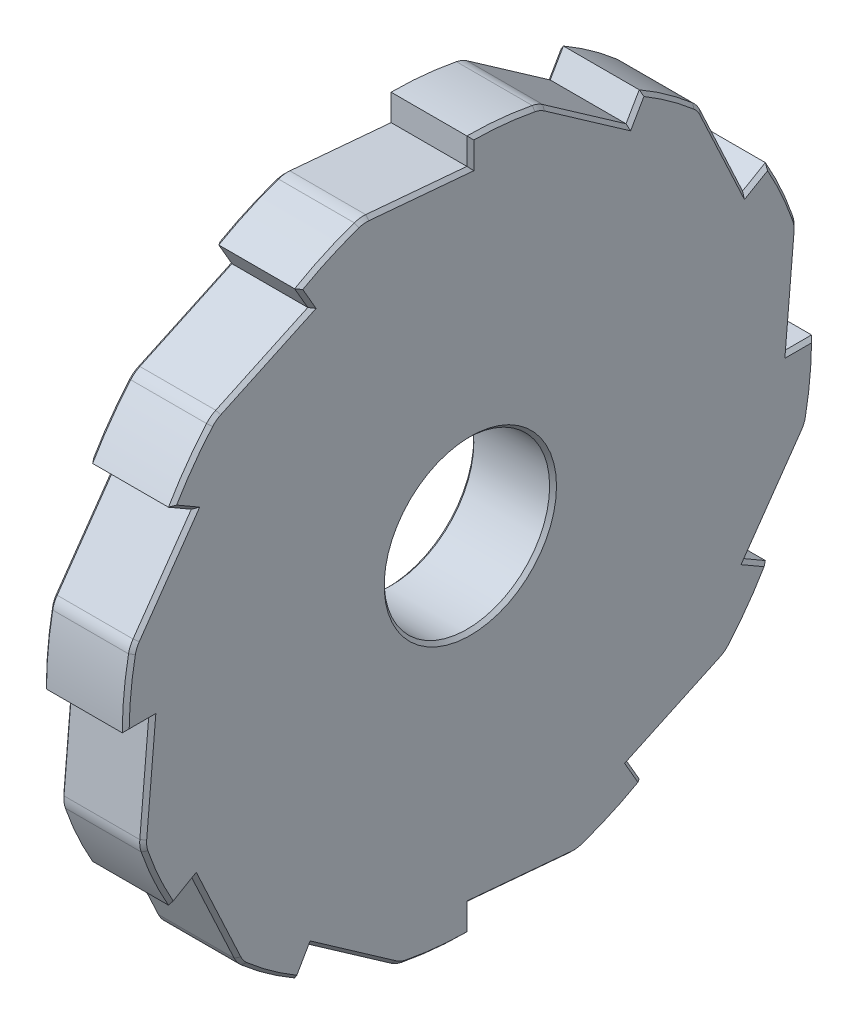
from build123d import *

# Parameters (mm, degrees)
SKETCH_1_R      = 6
EXTRUDE_1_DEPTH = 6
CHAMFER_1_SIZE  = 0.25


with BuildPart() as part:
    # Sketch 1 → Extrude 1 (new body)
    with BuildSketch(Plane(origin=(0, 0, 0), x_dir=(0, 0, -1), z_dir=(1, 0, 0))):
        with BuildLine():
            Line((5.506456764, 24.221456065), (11.543866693, 19.994563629))
            Line((11.543866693, 19.994563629), (12.5, 21.650635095))
            ThreePointArc((12.5, 21.650635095), (14.504409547, 20.362271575), (16.377060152, 18.888935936))
            ThreePointArc((16.377060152, 18.888935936), (16.663351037, 18.582532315), (16.879459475, 18.223167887))
            Line((16.879459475, 18.223167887), (19.994563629, 11.543866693))
            Line((19.994563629, 11.543866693), (21.650635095, 12.5))
            ThreePointArc((21.650635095, 12.5), (22.742322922, 10.382039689), (23.627418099, 8.169768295))
            ThreePointArc((23.627418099, 8.169768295), (23.722151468, 7.761269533), (23.729624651, 7.34199659))
            Line((23.729624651, 7.34199659), (23.087733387, 0))
            Line((23.087733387, 0), (25, 0))
            ThreePointArc((25, 0), (24.886449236, -2.380051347), (24.546828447, -4.738482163))
            ThreePointArc((24.546828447, -4.738482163), (24.42462057, -5.139619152), (24.221456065, -5.506456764))
            Line((24.221456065, -5.506456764), (19.994563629, -11.543866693))
            Line((19.994563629, -11.543866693), (21.650635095, -12.5))
            ThreePointArc((21.650635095, -12.5), (20.362271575, -14.504409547), (18.888935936, -16.377060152))
            ThreePointArc((18.888935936, -16.377060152), (18.582532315, -16.663351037), (18.223167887, -16.879459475))
            Line((18.223167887, -16.879459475), (11.543866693, -19.994563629))
            Line((11.543866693, -19.994563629), (12.5, -21.650635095))
            ThreePointArc((12.5, -21.650635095), (10.382039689, -22.742322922), (8.169768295, -23.627418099))
            ThreePointArc((8.169768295, -23.627418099), (7.761269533, -23.722151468), (7.34199659, -23.729624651))
            Line((7.34199659, -23.729624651), (0, -23.087733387))
            Line((0, -23.087733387), (0, -25))
            ThreePointArc((0, -25), (-2.380051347, -24.886449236), (-4.738482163, -24.546828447))
            ThreePointArc((-4.738482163, -24.546828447), (-5.139619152, -24.42462057), (-5.506456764, -24.221456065))
            Line((-5.506456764, -24.221456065), (-11.543866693, -19.994563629))
            Line((-11.543866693, -19.994563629), (-12.5, -21.650635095))
            ThreePointArc((-12.5, -21.650635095), (-14.504409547, -20.362271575), (-16.377060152, -18.888935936))
            ThreePointArc((-16.377060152, -18.888935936), (-16.663351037, -18.582532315), (-16.879459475, -18.223167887))
            Line((-16.879459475, -18.223167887), (-19.994563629, -11.543866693))
            Line((-19.994563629, -11.543866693), (-21.650635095, -12.5))
            ThreePointArc((-21.650635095, -12.5), (-22.742322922, -10.382039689), (-23.627418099, -8.169768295))
            ThreePointArc((-23.627418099, -8.169768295), (-23.722151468, -7.761269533), (-23.729624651, -7.34199659))
            Line((-23.729624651, -7.34199659), (-23.087733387, 0))
            Line((-23.087733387, 0), (-25, 0))
            ThreePointArc((-25, 0), (-24.886449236, 2.380051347), (-24.546828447, 4.738482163))
            ThreePointArc((-24.546828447, 4.738482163), (-24.42462057, 5.139619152), (-24.221456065, 5.506456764))
            Line((-24.221456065, 5.506456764), (-19.994563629, 11.543866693))
            Line((-19.994563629, 11.543866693), (-21.650635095, 12.5))
            ThreePointArc((-21.650635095, 12.5), (-20.362271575, 14.504409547), (-18.888935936, 16.377060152))
            ThreePointArc((-18.888935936, 16.377060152), (-18.582532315, 16.663351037), (-18.223167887, 16.879459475))
            Line((-18.223167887, 16.879459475), (-11.543866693, 19.994563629))
            Line((-11.543866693, 19.994563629), (-12.5, 21.650635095))
            ThreePointArc((-12.5, 21.650635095), (-10.382039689, 22.742322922), (-8.169768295, 23.627418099))
            ThreePointArc((-8.169768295, 23.627418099), (-7.761269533, 23.722151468), (-7.34199659, 23.729624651))
            Line((-7.34199659, 23.729624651), (0, 23.087733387))
            Line((0, 23.087733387), (0, 25))
            ThreePointArc((0, 25), (2.380051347, 24.886449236), (4.738482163, 24.546828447))
            ThreePointArc((4.738482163, 24.546828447), (5.139619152, 24.42462057), (5.506456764, 24.221456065))
        make_face()
        Circle(SKETCH_1_R, mode=Mode.SUBTRACT)
    extrude(amount=EXTRUDE_1_DEPTH)

    # Chamfer 1
    chamfer_1_edges = [part.edges().sort_by_distance(p)[0] for p in [
        (6, 24.043866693, 0),
        (6, -16.663351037, -18.582532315),
        (6, -14.504409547, -20.362271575),
        (6, -12.021933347, -20.822599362),
        (0, 0, 6),
        (6, -8.525161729, -22.108009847),
        (6, 0, 6),
        (6, -5.139619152, -24.42462057),
        (6, -2.380051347, -24.886449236),
        (6, 0, -24.043866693),
        (6, 3.670998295, -23.408679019),
        (6, 7.761269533, -23.722151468),
        (6, 10.382039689, -22.742322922),
        (6, 23.408679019, 3.670998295),
        (6, 12.021933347, -20.822599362),
        (6, 14.88351729, -18.437011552),
        (6, 18.582532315, -16.663351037),
        (6, 20.362271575, -14.504409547),
        (6, 20.822599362, -12.021933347),
        (6, 22.108009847, -8.525161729),
        (6, 23.722151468, 7.761269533),
        (6, 22.742322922, 10.382039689),
        (6, 20.822599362, 12.021933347),
        (6, 18.437011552, 14.88351729),
        (6, 16.663351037, 18.582532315),
        (6, 14.504409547, 20.362271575),
        (6, 12.021933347, 20.822599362),
        (6, 8.525161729, 22.108009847),
        (0, 22.108009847, -8.525161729),
        (6, 24.42462057, -5.139619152),
        (6, 5.139619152, 24.42462057),
        (0, 20.822599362, -12.021933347),
        (0, 20.362271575, -14.504409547),
        (0, 18.582532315, -16.663351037),
        (0, 14.88351729, -18.437011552),
        (0, 12.021933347, -20.822599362),
        (0, 10.382039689, -22.742322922),
        (0, 7.761269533, -23.722151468),
        (0, 3.670998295, -23.408679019),
        (6, 2.380051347, 24.886449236),
        (0, 0, -24.043866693),
        (0, -2.380051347, -24.886449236),
        (0, -5.139619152, -24.42462057),
        (0, -8.525161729, -22.108009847),
        (0, -12.021933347, -20.822599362),
        (0, -14.504409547, -20.362271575),
        (0, -16.663351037, -18.582532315),
        (6, 0, 24.043866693),
        (0, -18.437011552, -14.88351729),
        (0, -20.822599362, -12.021933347),
        (0, -22.742322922, -10.382039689),
        (0, -23.722151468, -7.761269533),
        (0, -23.408679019, -3.670998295),
        (0, -24.043866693, 0),
        (0, -24.886449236, 2.380051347),
        (0, -24.42462057, 5.139619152),
        (6, -3.670998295, 23.408679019),
        (0, -22.108009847, 8.525161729),
        (0, -20.822599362, 12.021933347),
        (0, -20.362271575, 14.504409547),
        (0, -18.582532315, 16.663351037),
        (0, -14.88351729, 18.437011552),
        (0, -12.021933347, 20.822599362),
        (0, -10.382039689, 22.742322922),
        (6, -7.761269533, 23.722151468),
        (0, -7.761269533, 23.722151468),
        (0, -3.670998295, 23.408679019),
        (0, 0, 24.043866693),
        (0, 2.380051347, 24.886449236),
        (0, 5.139619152, 24.42462057),
        (0, 8.525161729, 22.108009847),
        (0, 12.021933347, 20.822599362),
        (0, 14.504409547, 20.362271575),
        (6, -10.382039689, 22.742322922),
        (0, 16.663351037, 18.582532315),
        (0, 18.437011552, 14.88351729),
        (0, 20.822599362, 12.021933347),
        (0, 22.742322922, 10.382039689),
        (0, 23.722151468, 7.761269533),
        (0, 23.408679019, 3.670998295),
        (0, 24.043866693, 0),
        (6, -12.021933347, 20.822599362),
        (0, 24.886449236, -2.380051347),
        (0, 24.42462057, -5.139619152),
        (6, -14.88351729, 18.437011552),
        (6, -18.582532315, 16.663351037),
        (6, -20.362271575, 14.504409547),
        (6, 24.886449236, -2.380051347),
        (6, -20.822599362, 12.021933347),
        (6, -22.108009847, 8.525161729),
        (6, -24.42462057, 5.139619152),
        (6, -24.886449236, 2.380051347),
        (6, -24.043866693, 0),
        (6, -23.408679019, -3.670998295),
        (6, -23.722151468, -7.761269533),
        (6, -22.742322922, -10.382039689),
        (6, -20.822599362, -12.021933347),
        (6, -18.437011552, -14.88351729),
    ]]
    chamfer(chamfer_1_edges, length=CHAMFER_1_SIZE)


solid = part.part
